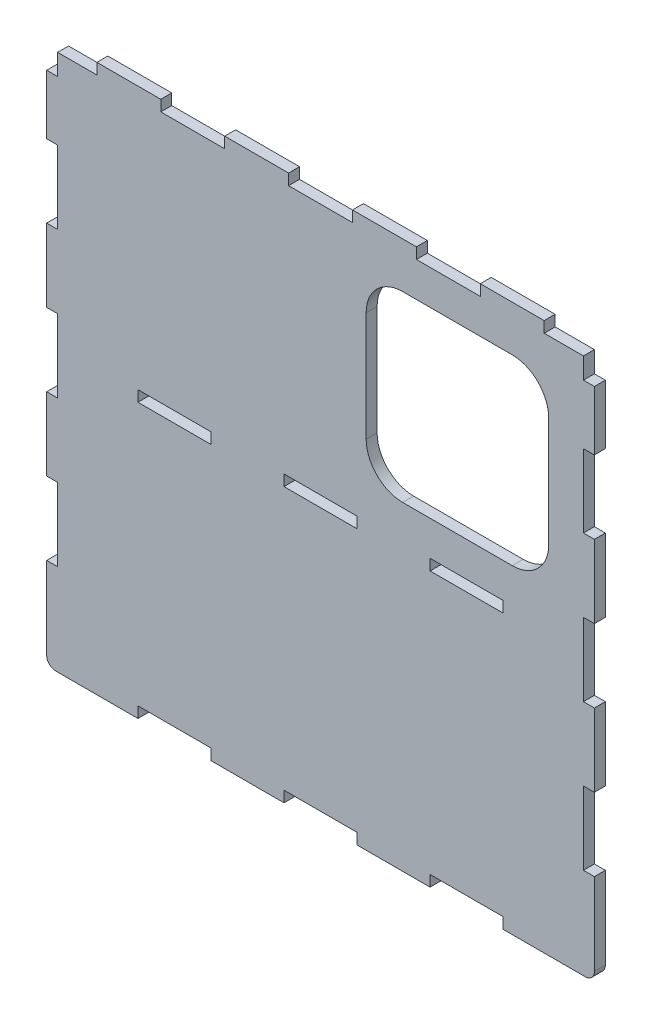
from build123d import *

# Parameters (mm, degrees)
BOSS_EXTRUDE1_DEPTH = 12
SKETCH2_W           = 12
SKETCH2_H           = 23
SKETCH2_W_2         = 70
SKETCH2_H_2         = 12
CUT_EXTRUDE2_DEPTH  = 425.433740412
SKETCH4_W           = 80
SKETCH4_H           = 12
CUT_EXTRUDE3_DEPTH  = 425.433740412


with BuildPart() as part:
    # Sketch1 → Boss-Extrude1 (new body)
    with BuildSketch(Plane.XY):
        with BuildLine():
            Line((-300, 290), (-300, 200))
            Line((-300, 200), (-288, 200))
            Line((-288, 200), (-288, 120))
            Line((-288, 120), (-300, 120))
            Line((-300, 120), (-300, 40))
            Line((-300, 40), (-288, 40))
            Line((-288, 40), (-288, -40))
            Line((-288, -40), (-300, -40))
            Line((-300, -40), (-300, -120))
            Line((-300, -120), (-288, -120))
            Line((-288, -120), (-288, -200))
            Line((-288, -200), (-300, -200))
            Line((-300, -200), (-300, -290))
            ThreePointArc((-300, -290), (-297.071067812, -297.071067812), (-290, -300))
            Line((-290, -300), (-200, -300))
            Line((-200, -300), (-200, -288))
            Line((-200, -288), (-120, -288))
            Line((-120, -288), (-120, -300))
            Line((-120, -300), (-40, -300))
            Line((-40, -300), (-40, -288))
            Line((-40, -288), (40, -288))
            Line((40, -288), (40, -300))
            Line((40, -300), (120, -300))
            Line((120, -300), (120, -288))
            Line((120, -288), (200, -288))
            Line((200, -288), (200, -300))
            Line((200, -300), (290, -300))
            ThreePointArc((290, -300), (297.071067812, -297.071067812), (300, -290))
            Line((300, -290), (300, -200))
            Line((300, -200), (288, -200))
            Line((288, -200), (288, -120))
            Line((288, -120), (300, -120))
            Line((300, -120), (300, -40))
            Line((300, -40), (288, -40))
            Line((288, -40), (288, 40))
            Line((288, 40), (300, 40))
            Line((300, 40), (300, 120))
            Line((300, 120), (288, 120))
            Line((288, 120), (288, 200))
            Line((288, 200), (300, 200))
            Line((300, 200), (300, 290))
            ThreePointArc((300, 290), (297.071067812, 297.071067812), (290, 300))
            Line((290, 300), (175, 300))
            Line((175, 300), (175, 288))
            Line((175, 288), (105, 288))
            Line((105, 288), (105, 300))
            Line((105, 300), (35, 300))
            Line((35, 300), (35, 288))
            Line((35, 288), (-35, 288))
            Line((-35, 288), (-35, 300))
            Line((-35, 300), (-105, 300))
            Line((-105, 300), (-105, 288))
            Line((-105, 288), (-175, 288))
            Line((-175, 288), (-175, 300))
            Line((-175, 300), (-290, 300))
            ThreePointArc((-290, 300), (-297.071067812, 297.071067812), (-300, 290))
        make_face()
    extrude(amount=BOSS_EXTRUDE1_DEPTH)

    # Sketch2 → Cut-Extrude2 (cut, through all)
    with BuildSketch(Plane.XY.offset(12)):
        with Locations((294, 276.5)):
            Rectangle(SKETCH2_W, SKETCH2_H)
        with Locations((280, 294)):
            Rectangle(SKETCH2_W_2, SKETCH2_H_2)
        with BuildLine():
            Line((50, 210), (50, 90))
            ThreePointArc((50, 90), (61.715728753, 61.715728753), (90, 50))
            Line((90, 50), (210, 50))
            ThreePointArc((210, 50), (238.284271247, 61.715728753), (250, 90))
            Line((250, 90), (250, 210))
            ThreePointArc((250, 210), (238.284271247, 238.284271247), (210, 250))
            Line((210, 250), (90, 250))
            ThreePointArc((90, 250), (61.715728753, 238.284271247), (50, 210))
        make_face()
        with Locations((-280, 294)):
            Rectangle(SKETCH2_W_2, SKETCH2_H_2)
        with Locations((-294, 276.5)):
            Rectangle(SKETCH2_W, SKETCH2_H)
    extrude(amount=-CUT_EXTRUDE2_DEPTH, mode=Mode.SUBTRACT)

    # Sketch4 → Cut-Extrude3 (cut, through all)
    with BuildSketch(Plane.XY.offset(12)):
        with Locations((-160, 6)):
            Rectangle(SKETCH4_W, SKETCH4_H)
        with Locations((0, 6)):
            Rectangle(SKETCH4_W, SKETCH4_H)
        with Locations((160, 6)):
            Rectangle(SKETCH4_W, SKETCH4_H)
    extrude(amount=-CUT_EXTRUDE3_DEPTH, mode=Mode.SUBTRACT)


solid = part.part
